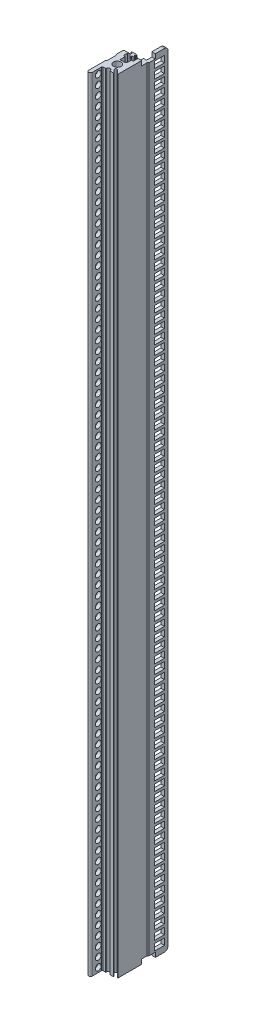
from build123d import *

# Parameters (mm, degrees)
SKETCH_1_R          = 1.6
EXTRUDE_1_DEPTH     = 215.9
SKETCH_8_W          = 5.4
SKETCH_8_H          = 2.5
SKETCH_8_H_2        = 1.2
CUT_EXTRUDE_6_DEPTH = 433.0893889
FILLET_2_R          = 0.2
EXTRUDE_2_DEPTH     = 431.8
SKETCH_2_R          = 2.1
CUT_EXTRUDE_1_DEPTH = 10
CUT_EXTRUDE_START   = -10
SKETCH_3_R          = 2.1
CUT_EXTRUDE_2_DEPTH = 10
SKETCH_4_R          = 1.65
CUT_EXTRUDE_3_DEPTH = 12
SKETCH_5_W          = 7
SKETCH_5_H          = 2.54
CUT_EXTRUDE_4_DEPTH = 218.32305446
SKETCH_7_W          = 5.5
SKETCH_7_H          = 3.6
CUT_EXTRUDE_5_DEPTH = 10
FILLET_1_R          = 2


with BuildPart() as part:
    # Sketch 1 → Extrude 1 (new, symmetric)
    with BuildSketch(Plane(origin=(0, 0, 0), x_dir=(1, 0, 0), z_dir=(0, 1, 0))):
        with BuildLine():
            Line((-4.20000049, 11.89999994), (-3.89999944, 11.899999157))
            ThreePointArc((-3.89999944, 11.899999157), (-3.758578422, 11.841420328), (-3.699999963, 11.699999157))
            Line((-3.699999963, 11.699999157), (-3.699999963, 9.94999994))
            ThreePointArc((-3.699999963, 9.94999994), (-3.758578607, 9.808578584), (-3.899999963, 9.74999994))
            Line((-3.899999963, 9.74999994), (-4.25, 9.74999994))
            ThreePointArc((-4.25, 9.74999994), (-4.391421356, 9.691421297), (-4.45, 9.54999994))
            Line((-4.45, 9.54999994), (-4.45, 8.5))
            Line((-4.45, 8.5), (-4.7, 8.5))
            Line((-4.7, 8.5), (-5, 8.2))
            Line((-5, 8.2), (-5, 7.4))
            Line((-5, 7.4), (-5, 4.4))
            Line((-5, 4.4), (-4.549867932, 3.899804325))
            Line((-4.549867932, 3.899804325), (-4.550132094, -1.100195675))
            Line((-4.550132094, -1.100195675), (-5, -1.6))
            Line((-5, -1.6), (-5, -10.75))
            ThreePointArc((-5, -10.75), (-4, -11.75), (-3, -10.75))
            Line((-3, -10.75), (-3, -5.75))
            ThreePointArc((-3, -5.75), (-2.853553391, -5.396446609), (-2.5, -5.25))
            Line((-2.5, -5.25), (-1.15000013, -5.25))
            ThreePointArc((-1.15000013, -5.25), (-1.079289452, -5.220710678), (-1.05000013, -5.15))
            Line((-1.05000013, -5.15), (-1.05000013, -5))
            ThreePointArc((-1.05000013, -5), (-1.3e-07, -3.95), (1.04999987, -5))
            Line((1.04999987, -5), (1.04999987, -5.15))
            ThreePointArc((1.04999987, -5.15), (1.079289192, -5.220710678), (1.14999987, -5.25))
            Line((1.14999987, -5.25), (3.070348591, -5.25))
            ThreePointArc((3.070348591, -5.25), (3.255124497, -5.126536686), (3.211769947, -4.908578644))
            Line((3.211769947, -4.908578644), (1.688730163, -3.385538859))
            ThreePointArc((1.688730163, -3.385538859), (1.688730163, -2.537010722), (2.5372583, -2.537010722))
            Line((2.5372583, -2.537010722), (4.658578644, -4.658331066))
            ThreePointArc((4.658578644, -4.658331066), (4.876536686, -4.701685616), (5, -4.516909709))
            Line((5, -4.516909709), (5, -2.080961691))
            Line((5, -2.080961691), (5, 5.179349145))
            Line((5, 5.179349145), (5, 15))
            Line((5, 15), (3.59999987, 15))
            Line((3.59999987, 15), (3.59999987, 12.5))
            Line((3.59999987, 12.5), (1.94999987, 12.5))
            Line((1.94999987, 12.5), (1.94999987, 10.55))
            Line((1.94999987, 10.55), (2.84999987, 10.55))
            Line((2.84999987, 10.55), (2.84999987, 9.35))
            Line((2.84999987, 9.35), (1.94999987, 9.35))
            Line((1.94999987, 9.35), (1.94999987, 8.35))
            Line((1.94999987, 8.35), (2.84999987, 8.35))
            Line((2.84999987, 8.35), (2.84999987, 6.05))
            Line((2.84999987, 6.05), (1.94999987, 6.05))
            Line((1.94999987, 6.05), (1.94999987, 3.885550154))
            ThreePointArc((1.94999987, 3.885550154), (1.567454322, 3.098943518), (0.71249987, 2.914162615))
            ThreePointArc((0.71249987, 2.914162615), (-0.242015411, 2.990222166), (-1.17187513, 2.761649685))
            ThreePointArc((-1.17187513, 2.761649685), (-1.360397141, 2.778988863), (-1.45000013, 2.945759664))
            Line((-1.45000013, 2.945759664), (-1.45000013, 6.05))
            Line((-1.45000013, 6.05), (-2.35000013, 6.05))
            Line((-2.35000013, 6.05), (-2.35000013, 8.35))
            Line((-2.35000013, 8.35), (-1.45000013, 8.35))
            Line((-1.45000013, 8.35), (-1.45000013, 9.35))
            Line((-1.45000013, 9.35), (-2.35000013, 9.35))
            Line((-2.35000013, 9.35), (-2.35000013, 10.55))
            Line((-2.35000013, 10.55), (-1.300000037, 10.55))
            Line((-1.300000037, 10.55), (-1.300000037, 10.617157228))
            ThreePointArc((-1.300000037, 10.617157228), (-1.315224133, 10.693693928), (-1.358578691, 10.758578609))
            Line((-1.358578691, 10.758578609), (-1.941421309, 11.341421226))
            ThreePointArc((-1.941421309, 11.341421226), (-1.984775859, 11.406305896), (-1.999999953, 11.482842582))
            Line((-1.999999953, 11.482842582), (-1.999999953, 11.699999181))
            ThreePointArc((-1.999999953, 11.699999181), (-1.941421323, 11.841420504), (-1.8, 11.899999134))
            Line((-1.8, 11.899999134), (-1.7, 11.899999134))
            ThreePointArc((-1.7, 11.899999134), (-1.558578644, 11.958577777), (-1.5, 12.099999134))
            Line((-1.5, 12.099999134), (-1.5, 12.199999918))
            ThreePointArc((-1.5, 12.199999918), (-1.558578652, 12.341421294), (-1.700000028, 12.399999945))
            Line((-1.700000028, 12.399999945), (-1.867157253, 12.399999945))
            ThreePointArc((-1.867157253, 12.399999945), (-1.943693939, 12.415224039), (-2.008578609, 12.458578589))
            Line((-2.008578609, 12.458578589), (-2.050000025, 12.500000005))
            Line((-2.050000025, 12.500000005), (-3.849999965, 12.500000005))
            Line((-3.849999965, 12.500000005), (-3.891421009, 12.458578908))
            ThreePointArc((-3.891421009, 12.458578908), (-3.95630571, 12.415224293), (-4.032842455, 12.400000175))
            Line((-4.032842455, 12.400000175), (-4.199999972, 12.400000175))
            ThreePointArc((-4.199999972, 12.400000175), (-4.341421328, 12.341421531), (-4.399999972, 12.200000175))
            Line((-4.399999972, 12.200000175), (-4.399999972, 12.099999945))
            ThreePointArc((-4.399999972, 12.099999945), (-4.341421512, 11.95857877), (-4.20000049, 11.89999994))
        make_face()
        with Locations(Location((-1.3e-07, 0, 0), (0, 0, 270))):
            Circle(SKETCH_1_R, mode=Mode.SUBTRACT)
    extrude(amount=EXTRUDE_1_DEPTH, both=True)

    # Sketch 8 → Cut-Extrude 6 (cut, through all)
    with BuildSketch(Plane(origin=(0, -215.9, 0), x_dir=(-1, 0, 0), z_dir=(0, -1, 0))):
        with Locations((-0.24999987, 7.1)):
            Rectangle(SKETCH_8_W, SKETCH_8_H)
        with Locations((-0.24999987, 9.95)):
            Rectangle(SKETCH_8_W, SKETCH_8_H_2)
    extrude(amount=-CUT_EXTRUDE_6_DEPTH, mode=Mode.SUBTRACT)

    # Fillet 2
    fillet_2_edges = [part.edges().sort_by_distance(p)[0] for p in [
        (-2.45000013, 0, -5.85),
        (2.94999987, 0, -8.35),
        (2.94999987, 0, -5.85),
        (-2.45000013, 0, -8.35),
        (-2.45000013, 0, -9.35),
        (2.94999987, 0, -10.55),
        (2.94999987, 0, -9.35),
        (-2.45000013, 0, -10.55),
    ]]
    fillet(fillet_2_edges, radius=FILLET_2_R)

    # Sketch 6 → Extrude 2 (add)
    with BuildSketch(Plane(origin=(0, 215.9, 0), x_dir=(1, 0, 0), z_dir=(0, 1, 0))):
        Polygon((3.59999987, 12.5), (3.59999987, 22.5), (5.5, 22.5), (5.5, 12), (5, 11.5), align=None)
    extrude(amount=-EXTRUDE_2_DEPTH)

    # Sketch 2 → Cut-Extrude 1 (cut)
    with BuildSketch(Plane(origin=(0, 215.9, 0), x_dir=(1, 0, 0), z_dir=(0, 1, 0))):
        with Locations(Location((0, 0, 0), (0, 0, 270))):
            Circle(SKETCH_2_R)
    extrude(amount=-CUT_EXTRUDE_1_DEPTH, mode=Mode.SUBTRACT)

    # Sketch 3 → Cut-Extrude 2 (cut)
    with BuildSketch(Plane.XZ.offset(215.9).offset(CUT_EXTRUDE_START)):
        with Locations(Location((0, 0, 0), (0, 0, 90))):
            Circle(SKETCH_3_R)
    extrude(amount=CUT_EXTRUDE_2_DEPTH, mode=Mode.SUBTRACT)

    # Sketch 4 → Cut-Extrude 3 (cut)
    with BuildSketch(Plane.ZY.offset(5)):
        with Locations((7.5, -213.36)):
            Circle(SKETCH_4_R)
        with Locations((7.5, -208.28)):
            Circle(SKETCH_4_R)
        with Locations((7.5, -203.2)):
            Circle(SKETCH_4_R)
        with Locations((7.5, -198.12)):
            Circle(SKETCH_4_R)
        with Locations((7.5, -193.04)):
            Circle(SKETCH_4_R)
        with Locations((7.5, -187.96)):
            Circle(SKETCH_4_R)
        with Locations((7.5, -182.88)):
            Circle(SKETCH_4_R)
        with Locations((7.5, -177.8)):
            Circle(SKETCH_4_R)
        with Locations((7.5, -172.72)):
            Circle(SKETCH_4_R)
        with Locations((7.5, -167.64)):
            Circle(SKETCH_4_R)
        with Locations((7.5, -162.56)):
            Circle(SKETCH_4_R)
        with Locations((7.5, -157.48)):
            Circle(SKETCH_4_R)
        with Locations((7.5, -152.4)):
            Circle(SKETCH_4_R)
        with Locations((7.5, -147.32)):
            Circle(SKETCH_4_R)
        with Locations((7.5, -142.24)):
            Circle(SKETCH_4_R)
        with Locations((7.5, -137.16)):
            Circle(SKETCH_4_R)
        with Locations((7.5, -132.08)):
            Circle(SKETCH_4_R)
        with Locations((7.5, -127)):
            Circle(SKETCH_4_R)
        with Locations((7.5, -121.92)):
            Circle(SKETCH_4_R)
        with Locations((7.5, -116.84)):
            Circle(SKETCH_4_R)
        with Locations((7.5, -111.76)):
            Circle(SKETCH_4_R)
        with Locations((7.5, -106.68)):
            Circle(SKETCH_4_R)
        with Locations((7.5, -101.6)):
            Circle(SKETCH_4_R)
        with Locations((7.5, -96.52)):
            Circle(SKETCH_4_R)
        with Locations((7.5, -91.44)):
            Circle(SKETCH_4_R)
        with Locations((7.5, -86.36)):
            Circle(SKETCH_4_R)
        with Locations((7.5, -81.28)):
            Circle(SKETCH_4_R)
        with Locations((7.5, -76.2)):
            Circle(SKETCH_4_R)
        with Locations((7.5, -71.12)):
            Circle(SKETCH_4_R)
        with Locations((7.5, -66.04)):
            Circle(SKETCH_4_R)
        with Locations((7.5, -60.96)):
            Circle(SKETCH_4_R)
        with Locations((7.5, -55.88)):
            Circle(SKETCH_4_R)
        with Locations((7.5, -50.8)):
            Circle(SKETCH_4_R)
        with Locations((7.5, -45.72)):
            Circle(SKETCH_4_R)
        with Locations((7.5, -40.64)):
            Circle(SKETCH_4_R)
        with Locations((7.5, -35.56)):
            Circle(SKETCH_4_R)
        with Locations((7.5, -30.48)):
            Circle(SKETCH_4_R)
        with Locations((7.5, -25.4)):
            Circle(SKETCH_4_R)
        with Locations((7.5, -20.32)):
            Circle(SKETCH_4_R)
        with Locations((7.5, -15.24)):
            Circle(SKETCH_4_R)
        with Locations((7.5, -10.16)):
            Circle(SKETCH_4_R)
        with Locations((7.5, -5.08)):
            Circle(SKETCH_4_R)
        with Locations((7.5, 0)):
            Circle(SKETCH_4_R)
        with Locations((7.5, 5.08)):
            Circle(SKETCH_4_R)
        with Locations((7.5, 10.16)):
            Circle(SKETCH_4_R)
        with Locations((7.5, 15.24)):
            Circle(SKETCH_4_R)
        with Locations((7.5, 20.32)):
            Circle(SKETCH_4_R)
        with Locations((7.5, 25.4)):
            Circle(SKETCH_4_R)
        with Locations((7.5, 30.48)):
            Circle(SKETCH_4_R)
        with Locations((7.5, 35.56)):
            Circle(SKETCH_4_R)
        with Locations((7.5, 40.64)):
            Circle(SKETCH_4_R)
        with Locations((7.5, 45.72)):
            Circle(SKETCH_4_R)
        with Locations((7.5, 50.8)):
            Circle(SKETCH_4_R)
        with Locations((7.5, 55.88)):
            Circle(SKETCH_4_R)
        with Locations((7.5, 60.96)):
            Circle(SKETCH_4_R)
        with Locations((7.5, 66.04)):
            Circle(SKETCH_4_R)
        with Locations((7.5, 71.12)):
            Circle(SKETCH_4_R)
        with Locations((7.5, 76.2)):
            Circle(SKETCH_4_R)
        with Locations((7.5, 81.28)):
            Circle(SKETCH_4_R)
        with Locations((7.5, 86.36)):
            Circle(SKETCH_4_R)
        with Locations((7.5, 91.44)):
            Circle(SKETCH_4_R)
        with Locations((7.5, 96.52)):
            Circle(SKETCH_4_R)
        with Locations((7.5, 101.6)):
            Circle(SKETCH_4_R)
        with Locations((7.5, 106.68)):
            Circle(SKETCH_4_R)
        with Locations((7.5, 111.76)):
            Circle(SKETCH_4_R)
        with Locations((7.5, 116.84)):
            Circle(SKETCH_4_R)
        with Locations((7.5, 121.92)):
            Circle(SKETCH_4_R)
        with Locations((7.5, 127)):
            Circle(SKETCH_4_R)
        with Locations((7.5, 132.08)):
            Circle(SKETCH_4_R)
        with Locations((7.5, 137.16)):
            Circle(SKETCH_4_R)
        with Locations((7.5, 142.24)):
            Circle(SKETCH_4_R)
        with Locations((7.5, 147.32)):
            Circle(SKETCH_4_R)
        with Locations((7.5, 152.4)):
            Circle(SKETCH_4_R)
        with Locations((7.5, 157.48)):
            Circle(SKETCH_4_R)
        with Locations((7.5, 162.56)):
            Circle(SKETCH_4_R)
        with Locations((7.5, 167.64)):
            Circle(SKETCH_4_R)
        with Locations((7.5, 172.72)):
            Circle(SKETCH_4_R)
        with Locations((7.5, 177.8)):
            Circle(SKETCH_4_R)
        with Locations((7.5, 182.88)):
            Circle(SKETCH_4_R)
        with Locations((7.5, 187.96)):
            Circle(SKETCH_4_R)
        with Locations((7.5, 193.04)):
            Circle(SKETCH_4_R)
        with Locations((7.5, 198.12)):
            Circle(SKETCH_4_R)
        with Locations((7.5, 203.2)):
            Circle(SKETCH_4_R)
        with Locations((7.5, 208.28)):
            Circle(SKETCH_4_R)
        with Locations((7.5, 213.36)):
            Circle(SKETCH_4_R)
    extrude(amount=-CUT_EXTRUDE_3_DEPTH, mode=Mode.SUBTRACT)

    # Sketch 5 → Cut-Extrude 4 (cut, through all)
    with BuildSketch(Plane(origin=(5.5, 0, 0), x_dir=(0, 0, -1), z_dir=(1, 0, 0))):
        with Locations((12, 214.63)):
            Rectangle(SKETCH_5_W, SKETCH_5_H)
        with Locations((12, -214.63)):
            Rectangle(SKETCH_5_W, SKETCH_5_H)
    extrude(amount=-CUT_EXTRUDE_4_DEPTH, mode=Mode.SUBTRACT)

    # Sketch 7 → Cut-Extrude 5 (cut)
    with BuildSketch(Plane(origin=(5.5, 0, 0), x_dir=(0, 0, -1), z_dir=(1, 0, 0))):
        with Locations((17.75, -210.82)):
            Rectangle(SKETCH_7_W, SKETCH_7_H)
        with Locations((17.75, -205.74)):
            Rectangle(SKETCH_7_W, SKETCH_7_H)
        with Locations((17.75, -200.66)):
            Rectangle(SKETCH_7_W, SKETCH_7_H)
        with Locations((17.75, -195.58)):
            Rectangle(SKETCH_7_W, SKETCH_7_H)
        with Locations((17.75, -190.5)):
            Rectangle(SKETCH_7_W, SKETCH_7_H)
        with Locations((17.75, -185.42)):
            Rectangle(SKETCH_7_W, SKETCH_7_H)
        with Locations((17.75, -180.34)):
            Rectangle(SKETCH_7_W, SKETCH_7_H)
        with Locations((17.75, -175.26)):
            Rectangle(SKETCH_7_W, SKETCH_7_H)
        with Locations((17.75, -170.18)):
            Rectangle(SKETCH_7_W, SKETCH_7_H)
        with Locations((17.75, -165.1)):
            Rectangle(SKETCH_7_W, SKETCH_7_H)
        with Locations((17.75, -160.02)):
            Rectangle(SKETCH_7_W, SKETCH_7_H)
        with Locations((17.75, -154.94)):
            Rectangle(SKETCH_7_W, SKETCH_7_H)
        with Locations((17.75, -149.86)):
            Rectangle(SKETCH_7_W, SKETCH_7_H)
        with Locations((17.75, -144.78)):
            Rectangle(SKETCH_7_W, SKETCH_7_H)
        with Locations((17.75, -139.7)):
            Rectangle(SKETCH_7_W, SKETCH_7_H)
        with Locations((17.75, -134.62)):
            Rectangle(SKETCH_7_W, SKETCH_7_H)
        with Locations((17.75, -129.54)):
            Rectangle(SKETCH_7_W, SKETCH_7_H)
        with Locations((17.75, -124.46)):
            Rectangle(SKETCH_7_W, SKETCH_7_H)
        with Locations((17.75, -119.38)):
            Rectangle(SKETCH_7_W, SKETCH_7_H)
        with Locations((17.75, -114.3)):
            Rectangle(SKETCH_7_W, SKETCH_7_H)
        with Locations((17.75, -109.22)):
            Rectangle(SKETCH_7_W, SKETCH_7_H)
        with Locations((17.75, -104.14)):
            Rectangle(SKETCH_7_W, SKETCH_7_H)
        with Locations((17.75, -99.06)):
            Rectangle(SKETCH_7_W, SKETCH_7_H)
        with Locations((17.75, -93.98)):
            Rectangle(SKETCH_7_W, SKETCH_7_H)
        with Locations((17.75, -88.9)):
            Rectangle(SKETCH_7_W, SKETCH_7_H)
        with Locations((17.75, -83.82)):
            Rectangle(SKETCH_7_W, SKETCH_7_H)
        with Locations((17.75, -78.74)):
            Rectangle(SKETCH_7_W, SKETCH_7_H)
        with Locations((17.75, -73.66)):
            Rectangle(SKETCH_7_W, SKETCH_7_H)
        with Locations((17.75, -68.58)):
            Rectangle(SKETCH_7_W, SKETCH_7_H)
        with Locations((17.75, -63.5)):
            Rectangle(SKETCH_7_W, SKETCH_7_H)
        with Locations((17.75, -58.42)):
            Rectangle(SKETCH_7_W, SKETCH_7_H)
        with Locations((17.75, -53.34)):
            Rectangle(SKETCH_7_W, SKETCH_7_H)
        with Locations((17.75, -48.26)):
            Rectangle(SKETCH_7_W, SKETCH_7_H)
        with Locations((17.75, -43.18)):
            Rectangle(SKETCH_7_W, SKETCH_7_H)
        with Locations((17.75, -38.1)):
            Rectangle(SKETCH_7_W, SKETCH_7_H)
        with Locations((17.75, -33.02)):
            Rectangle(SKETCH_7_W, SKETCH_7_H)
        with Locations((17.75, -27.94)):
            Rectangle(SKETCH_7_W, SKETCH_7_H)
        with Locations((17.75, -22.86)):
            Rectangle(SKETCH_7_W, SKETCH_7_H)
        with Locations((17.75, -17.78)):
            Rectangle(SKETCH_7_W, SKETCH_7_H)
        with Locations((17.75, -12.7)):
            Rectangle(SKETCH_7_W, SKETCH_7_H)
        with Locations((17.75, -7.62)):
            Rectangle(SKETCH_7_W, SKETCH_7_H)
        with Locations((17.75, -2.54)):
            Rectangle(SKETCH_7_W, SKETCH_7_H)
        with Locations((17.75, 2.54)):
            Rectangle(SKETCH_7_W, SKETCH_7_H)
        with Locations((17.75, 7.62)):
            Rectangle(SKETCH_7_W, SKETCH_7_H)
        with Locations((17.75, 12.7)):
            Rectangle(SKETCH_7_W, SKETCH_7_H)
        with Locations((17.75, 17.78)):
            Rectangle(SKETCH_7_W, SKETCH_7_H)
        with Locations((17.75, 22.86)):
            Rectangle(SKETCH_7_W, SKETCH_7_H)
        with Locations((17.75, 27.94)):
            Rectangle(SKETCH_7_W, SKETCH_7_H)
        with Locations((17.75, 33.02)):
            Rectangle(SKETCH_7_W, SKETCH_7_H)
        with Locations((17.75, 38.1)):
            Rectangle(SKETCH_7_W, SKETCH_7_H)
        with Locations((17.75, 43.18)):
            Rectangle(SKETCH_7_W, SKETCH_7_H)
        with Locations((17.75, 48.26)):
            Rectangle(SKETCH_7_W, SKETCH_7_H)
        with Locations((17.75, 53.34)):
            Rectangle(SKETCH_7_W, SKETCH_7_H)
        with Locations((17.75, 58.42)):
            Rectangle(SKETCH_7_W, SKETCH_7_H)
        with Locations((17.75, 63.5)):
            Rectangle(SKETCH_7_W, SKETCH_7_H)
        with Locations((17.75, 68.58)):
            Rectangle(SKETCH_7_W, SKETCH_7_H)
        with Locations((17.75, 73.66)):
            Rectangle(SKETCH_7_W, SKETCH_7_H)
        with Locations((17.75, 78.74)):
            Rectangle(SKETCH_7_W, SKETCH_7_H)
        with Locations((17.75, 83.82)):
            Rectangle(SKETCH_7_W, SKETCH_7_H)
        with Locations((17.75, 88.9)):
            Rectangle(SKETCH_7_W, SKETCH_7_H)
        with Locations((17.75, 93.98)):
            Rectangle(SKETCH_7_W, SKETCH_7_H)
        with Locations((17.75, 99.06)):
            Rectangle(SKETCH_7_W, SKETCH_7_H)
        with Locations((17.75, 104.14)):
            Rectangle(SKETCH_7_W, SKETCH_7_H)
        with Locations((17.75, 109.22)):
            Rectangle(SKETCH_7_W, SKETCH_7_H)
        with Locations((17.75, 114.3)):
            Rectangle(SKETCH_7_W, SKETCH_7_H)
        with Locations((17.75, 119.38)):
            Rectangle(SKETCH_7_W, SKETCH_7_H)
        with Locations((17.75, 124.46)):
            Rectangle(SKETCH_7_W, SKETCH_7_H)
        with Locations((17.75, 129.54)):
            Rectangle(SKETCH_7_W, SKETCH_7_H)
        with Locations((17.75, 134.62)):
            Rectangle(SKETCH_7_W, SKETCH_7_H)
        with Locations((17.75, 139.7)):
            Rectangle(SKETCH_7_W, SKETCH_7_H)
        with Locations((17.75, 144.78)):
            Rectangle(SKETCH_7_W, SKETCH_7_H)
        with Locations((17.75, 149.86)):
            Rectangle(SKETCH_7_W, SKETCH_7_H)
        with Locations((17.75, 154.94)):
            Rectangle(SKETCH_7_W, SKETCH_7_H)
        with Locations((17.75, 160.02)):
            Rectangle(SKETCH_7_W, SKETCH_7_H)
        with Locations((17.75, 165.1)):
            Rectangle(SKETCH_7_W, SKETCH_7_H)
        with Locations((17.75, 170.18)):
            Rectangle(SKETCH_7_W, SKETCH_7_H)
        with Locations((17.75, 175.26)):
            Rectangle(SKETCH_7_W, SKETCH_7_H)
        with Locations((17.75, 180.34)):
            Rectangle(SKETCH_7_W, SKETCH_7_H)
        with Locations((17.75, 185.42)):
            Rectangle(SKETCH_7_W, SKETCH_7_H)
        with Locations((17.75, 190.5)):
            Rectangle(SKETCH_7_W, SKETCH_7_H)
        with Locations((17.75, 195.58)):
            Rectangle(SKETCH_7_W, SKETCH_7_H)
        with Locations((17.75, 200.66)):
            Rectangle(SKETCH_7_W, SKETCH_7_H)
        with Locations((17.75, 205.74)):
            Rectangle(SKETCH_7_W, SKETCH_7_H)
        with Locations((17.75, 210.82)):
            Rectangle(SKETCH_7_W, SKETCH_7_H)
    extrude(amount=-CUT_EXTRUDE_5_DEPTH, mode=Mode.SUBTRACT)

    # Fillet 1
    fillet_1_edges = [part.edges().sort_by_distance(p)[0] for p in [
        (4.549999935, 215.9, -22.5),
        (4.549999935, -215.9, -22.5),
    ]]
    fillet(fillet_1_edges, radius=FILLET_1_R)


solid = part.part
